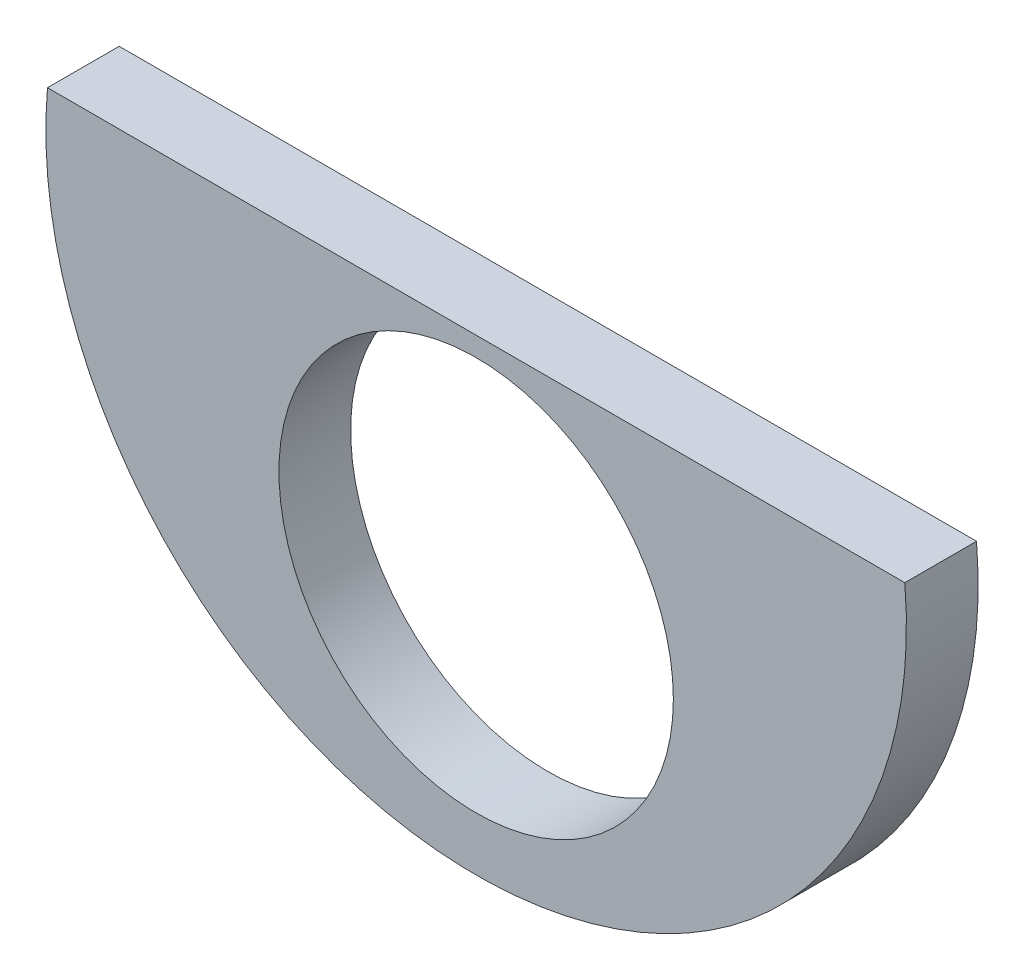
from build123d import *

# Parameters (mm, degrees)
EXTRUDE1_DEPTH     = 3.175
SKETCH4_R          = 8.73125
CUT_EXTRUDE3_DEPTH = 3.175


with BuildPart() as part:
    # Sketch1 → Extrude1 (new body)
    with BuildSketch(Plane.XY):
        with BuildLine():
            Line((-18.978321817, 1.651), (18.978321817, 1.651))
            ThreePointArc((18.978321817, 1.651), (0, -19.05), (-18.978321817, 1.651))
        make_face()
    extrude(amount=EXTRUDE1_DEPTH)

    # Sketch4 → Cut-Extrude3 (cut)
    with BuildSketch(Plane.XY.offset(3.175)):
        with Locations((0, -7.9375)):
            Circle(SKETCH4_R)
    extrude(amount=-CUT_EXTRUDE3_DEPTH, mode=Mode.SUBTRACT)


solid = part.part
